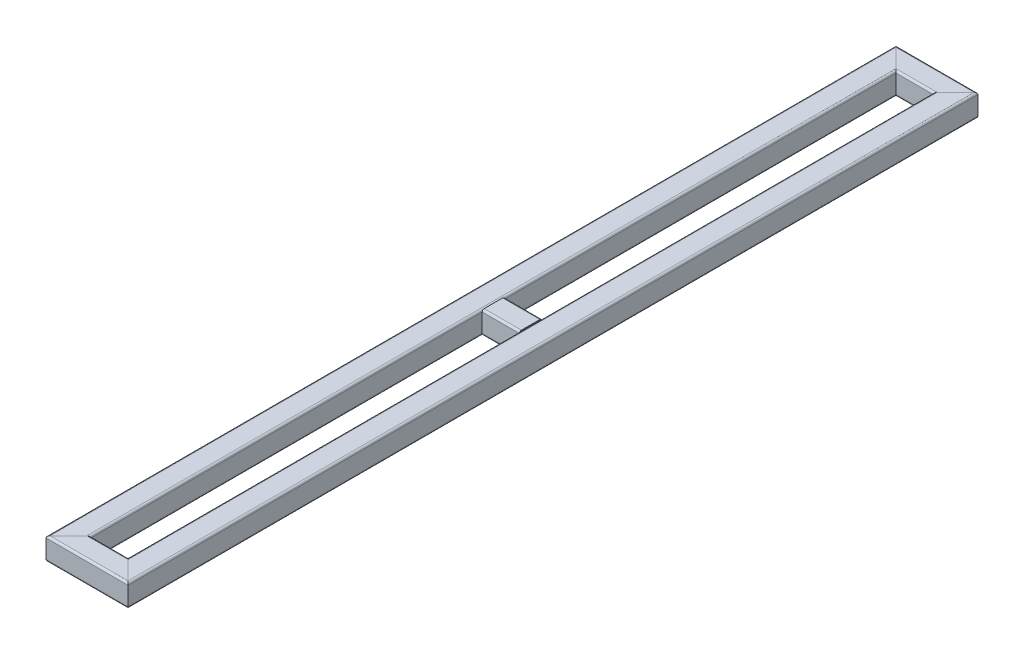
from build123d import *

# Parameters (mm, degrees)
EL_MENT_M_CANO_SOUD_1_DEPTH      = 1697.819805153
EL_MENT_M_CANO_SOUD_1_DEPTH_BACK = 32.819805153
EL_MENT_M_CANO_SOUD_1_2_DEPTH    = 185.639610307
EL_MENT_M_CANO_SOUD_1_3_DEPTH    = 1730.639610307
EL_MENT_M_CANO_SOUD_1_4_DEPTH    = 185.639610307
EL_MENT_M_CANO_SOUD_1_5_DEPTH    = 122


with BuildPart() as part:
    # Sketch11 → El_ment m_cano-soud_1 (new, two sides: drawn at the far end of the back side and taken through both)
    with BuildSketch(Plane.XY.offset(-1665).offset(-EL_MENT_M_CANO_SOUD_1_DEPTH_BACK)):
        with BuildLine():
            Line((-18.5, -22.5), (18.5, -22.5))
            ThreePointArc((18.5, -22.5), (21.328427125, -21.328427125), (22.5, -18.5))
            Line((22.5, -18.5), (22.5, 18.5))
            ThreePointArc((22.5, 18.5), (21.328427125, 21.328427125), (18.5, 22.5))
            Line((18.5, 22.5), (-18.5, 22.5))
            ThreePointArc((-18.5, 22.5), (-21.328427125, 21.328427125), (-22.5, 18.5))
            Line((-22.5, 18.5), (-22.5, -18.5))
            ThreePointArc((-22.5, -18.5), (-21.328427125, -21.328427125), (-18.5, -22.5))
        make_face()
        with BuildLine():
            Line((-18.5, -20.5), (18.5, -20.5))
            ThreePointArc((18.5, -20.5), (19.914213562, -19.914213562), (20.5, -18.5))
            Line((20.5, -18.5), (20.5, 18.5))
            ThreePointArc((20.5, 18.5), (19.914213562, 19.914213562), (18.5, 20.5))
            Line((18.5, 20.5), (-18.5, 20.5))
            ThreePointArc((-18.5, 20.5), (-19.914213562, 19.914213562), (-20.5, 18.5))
            Line((-20.5, 18.5), (-20.5, -18.5))
            ThreePointArc((-20.5, -18.5), (-19.914213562, -19.914213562), (-18.5, -20.5))
        make_face(mode=Mode.SUBTRACT)
    extrude(amount=EL_MENT_M_CANO_SOUD_1_DEPTH + EL_MENT_M_CANO_SOUD_1_DEPTH_BACK)

    # El_ment m_cano-soud_1 mitre 1
    split(bisect_by=Plane(origin=(0, 0, -1665), x_dir=(0, -1, 0), z_dir=(-0.707106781, 0, 0.707106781)), keep=Keep.TOP)

    # El_ment m_cano-soud_1 mitre 2
    split(bisect_by=Plane(origin=(0, 0, 0), x_dir=(0, -1, 0), z_dir=(-0.707106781, 0, -0.707106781)), keep=Keep.TOP)


with BuildPart() as body_2:
    # Sketch11 on segment 2 (on carried to segment 2) → El_ment m_cano-soud_1 2 (new body)
    with BuildSketch(Plane(origin=(-32.819805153, 0, 0), x_dir=(0, 0, -1), z_dir=(1, 0, 0))):
        with BuildLine():
            Line((-18.5, -22.5), (18.5, -22.5))
            ThreePointArc((18.5, -22.5), (21.328427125, -21.328427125), (22.5, -18.5))
            Line((22.5, -18.5), (22.5, 18.5))
            ThreePointArc((22.5, 18.5), (21.328427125, 21.328427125), (18.5, 22.5))
            Line((18.5, 22.5), (-18.5, 22.5))
            ThreePointArc((-18.5, 22.5), (-21.328427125, 21.328427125), (-22.5, 18.5))
            Line((-22.5, 18.5), (-22.5, -18.5))
            ThreePointArc((-22.5, -18.5), (-21.328427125, -21.328427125), (-18.5, -22.5))
        make_face()
        with BuildLine():
            Line((-18.5, -20.5), (18.5, -20.5))
            ThreePointArc((18.5, -20.5), (19.914213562, -19.914213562), (20.5, -18.5))
            Line((20.5, -18.5), (20.5, 18.5))
            ThreePointArc((20.5, 18.5), (19.914213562, 19.914213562), (18.5, 20.5))
            Line((18.5, 20.5), (-18.5, 20.5))
            ThreePointArc((-18.5, 20.5), (-19.914213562, 19.914213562), (-20.5, 18.5))
            Line((-20.5, 18.5), (-20.5, -18.5))
            ThreePointArc((-20.5, -18.5), (-19.914213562, -19.914213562), (-18.5, -20.5))
        make_face(mode=Mode.SUBTRACT)
    extrude(amount=EL_MENT_M_CANO_SOUD_1_2_DEPTH)

    # El_ment m_cano-soud_1 2 mitre 1
    split(bisect_by=Plane(origin=(0, 0, 0), x_dir=(0, 1, 0), z_dir=(0.707106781, 0, 0.707106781)), keep=Keep.TOP)

    # El_ment m_cano-soud_1 2 mitre 2
    split(bisect_by=Plane(origin=(120, 0, 0), x_dir=(0, -1, 0), z_dir=(-0.707106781, 0, 0.707106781)), keep=Keep.TOP)


with BuildPart() as body_3:
    # Sketch11 on segment 3 (on carried to segment 3) → El_ment m_cano-soud_1 3 (new body)
    with BuildSketch(Plane(origin=(120, 0, 32.819805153), x_dir=(-1, 0, 0), z_dir=(0, 0, -1))):
        with BuildLine():
            Line((-18.5, -22.5), (18.5, -22.5))
            ThreePointArc((18.5, -22.5), (21.328427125, -21.328427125), (22.5, -18.5))
            Line((22.5, -18.5), (22.5, 18.5))
            ThreePointArc((22.5, 18.5), (21.328427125, 21.328427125), (18.5, 22.5))
            Line((18.5, 22.5), (-18.5, 22.5))
            ThreePointArc((-18.5, 22.5), (-21.328427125, 21.328427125), (-22.5, 18.5))
            Line((-22.5, 18.5), (-22.5, -18.5))
            ThreePointArc((-22.5, -18.5), (-21.328427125, -21.328427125), (-18.5, -22.5))
        make_face()
        with BuildLine():
            Line((-18.5, -20.5), (18.5, -20.5))
            ThreePointArc((18.5, -20.5), (19.914213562, -19.914213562), (20.5, -18.5))
            Line((20.5, -18.5), (20.5, 18.5))
            ThreePointArc((20.5, 18.5), (19.914213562, 19.914213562), (18.5, 20.5))
            Line((18.5, 20.5), (-18.5, 20.5))
            ThreePointArc((-18.5, 20.5), (-19.914213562, 19.914213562), (-20.5, 18.5))
            Line((-20.5, 18.5), (-20.5, -18.5))
            ThreePointArc((-20.5, -18.5), (-19.914213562, -19.914213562), (-18.5, -20.5))
        make_face(mode=Mode.SUBTRACT)
    extrude(amount=EL_MENT_M_CANO_SOUD_1_3_DEPTH)

    # El_ment m_cano-soud_1 3 mitre 1
    split(bisect_by=Plane(origin=(120, 0, 0), x_dir=(0, 1, 0), z_dir=(0.707106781, 0, -0.707106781)), keep=Keep.TOP)

    # El_ment m_cano-soud_1 3 mitre 2
    split(bisect_by=Plane(origin=(120, 0, -1665), x_dir=(0, 1, 0), z_dir=(0.707106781, 0, 0.707106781)), keep=Keep.TOP)


with BuildPart() as body_4:
    # Sketch11 on segment 4 (on carried to segment 4) → El_ment m_cano-soud_1 4 (new body)
    with BuildSketch(Plane(origin=(152.819805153, 0, -1665), x_dir=(0, 0, 1), z_dir=(-1, 0, 0))):
        with BuildLine():
            Line((-18.5, -22.5), (18.5, -22.5))
            ThreePointArc((18.5, -22.5), (21.328427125, -21.328427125), (22.5, -18.5))
            Line((22.5, -18.5), (22.5, 18.5))
            ThreePointArc((22.5, 18.5), (21.328427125, 21.328427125), (18.5, 22.5))
            Line((18.5, 22.5), (-18.5, 22.5))
            ThreePointArc((-18.5, 22.5), (-21.328427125, 21.328427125), (-22.5, 18.5))
            Line((-22.5, 18.5), (-22.5, -18.5))
            ThreePointArc((-22.5, -18.5), (-21.328427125, -21.328427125), (-18.5, -22.5))
        make_face()
        with BuildLine():
            Line((-18.5, -20.5), (18.5, -20.5))
            ThreePointArc((18.5, -20.5), (19.914213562, -19.914213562), (20.5, -18.5))
            Line((20.5, -18.5), (20.5, 18.5))
            ThreePointArc((20.5, 18.5), (19.914213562, 19.914213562), (18.5, 20.5))
            Line((18.5, 20.5), (-18.5, 20.5))
            ThreePointArc((-18.5, 20.5), (-19.914213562, 19.914213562), (-20.5, 18.5))
            Line((-20.5, 18.5), (-20.5, -18.5))
            ThreePointArc((-20.5, -18.5), (-19.914213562, -19.914213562), (-18.5, -20.5))
        make_face(mode=Mode.SUBTRACT)
    extrude(amount=EL_MENT_M_CANO_SOUD_1_4_DEPTH)

    # El_ment m_cano-soud_1 4 mitre 1
    split(bisect_by=Plane(origin=(120, 0, -1665), x_dir=(0, -1, 0), z_dir=(-0.707106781, 0, -0.707106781)), keep=Keep.TOP)

    # El_ment m_cano-soud_1 4 mitre 2
    split(bisect_by=Plane(origin=(0, 0, -1665), x_dir=(0, 1, 0), z_dir=(0.707106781, 0, -0.707106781)), keep=Keep.TOP)


with BuildPart() as body_5:
    # Sketch11 on segment 5 (on carried to segment 5) → El_ment m_cano-soud_1 5 (new body)
    with BuildSketch(Plane(origin=(-1, 0, -832.5), x_dir=(0, 0, -1), z_dir=(1, 0, 0))):
        with BuildLine():
            Line((-18.5, -22.5), (18.5, -22.5))
            ThreePointArc((18.5, -22.5), (21.328427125, -21.328427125), (22.5, -18.5))
            Line((22.5, -18.5), (22.5, 18.5))
            ThreePointArc((22.5, 18.5), (21.328427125, 21.328427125), (18.5, 22.5))
            Line((18.5, 22.5), (-18.5, 22.5))
            ThreePointArc((-18.5, 22.5), (-21.328427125, 21.328427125), (-22.5, 18.5))
            Line((-22.5, 18.5), (-22.5, -18.5))
            ThreePointArc((-22.5, -18.5), (-21.328427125, -21.328427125), (-18.5, -22.5))
        make_face()
        with BuildLine():
            Line((-18.5, -20.5), (18.5, -20.5))
            ThreePointArc((18.5, -20.5), (19.914213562, -19.914213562), (20.5, -18.5))
            Line((20.5, -18.5), (20.5, 18.5))
            ThreePointArc((20.5, 18.5), (19.914213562, 19.914213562), (18.5, 20.5))
            Line((18.5, 20.5), (-18.5, 20.5))
            ThreePointArc((-18.5, 20.5), (-19.914213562, 19.914213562), (-20.5, 18.5))
            Line((-20.5, 18.5), (-20.5, -18.5))
            ThreePointArc((-20.5, -18.5), (-19.914213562, -19.914213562), (-18.5, -20.5))
        make_face(mode=Mode.SUBTRACT)
    extrude(amount=EL_MENT_M_CANO_SOUD_1_5_DEPTH)

    # El_ment m_cano-soud_1 5 mitre 1
    split(bisect_by=Plane(origin=(22.5, 0, -832.5), x_dir=(0, 1, 0), z_dir=(1, 0, 0)), keep=Keep.TOP)

    # El_ment m_cano-soud_1 5 mitre 2
    split(bisect_by=Plane(origin=(97.5, 0, -832.5), x_dir=(0, -1, 0), z_dir=(-1, 0, 0)), keep=Keep.TOP)


solid = Compound([part.part, body_2.part, body_3.part, body_4.part, body_5.part])
